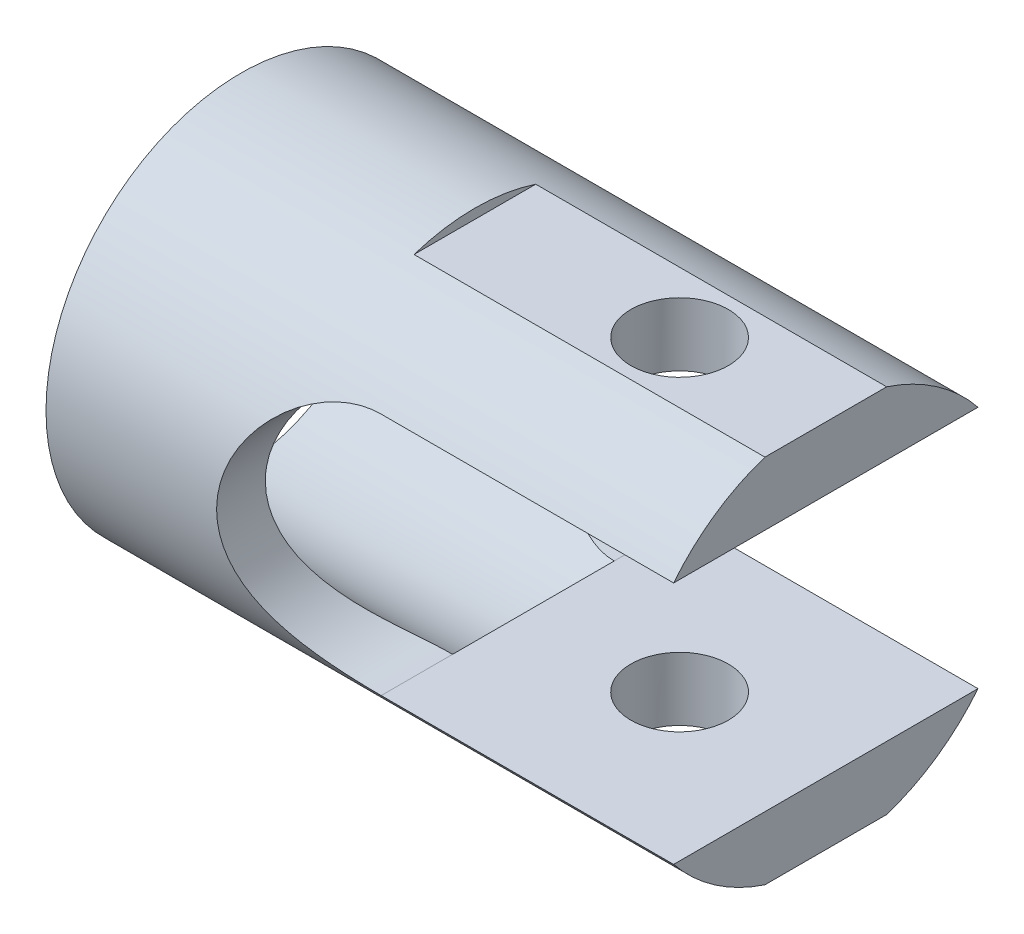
ISO-10303-21;
HEADER;
FILE_DESCRIPTION(('STEP AP214'),'2;1');
FILE_NAME('part.step','',(''),(''),'','','');
FILE_SCHEMA(('AUTOMOTIVE_DESIGN { 1 0 10303 214 1 1 1 1 }'));
ENDSEC;
DATA;
#1=APPLICATION_CONTEXT('core data for automotive mechanical design processes');
#2=APPLICATION_PROTOCOL_DEFINITION('international standard','automotive_design',2000,#1);
#3=PRODUCT_CONTEXT('',#1,'mechanical');
#4=PRODUCT('Part','Part','',(#3));
#5=PRODUCT_RELATED_PRODUCT_CATEGORY('part','',(#4));
#6=PRODUCT_DEFINITION_FORMATION('','',#4);
#7=PRODUCT_DEFINITION_CONTEXT('part definition',#1,'design');
#8=PRODUCT_DEFINITION('design','',#6,#7);
#9=PRODUCT_DEFINITION_SHAPE('','',#8);
#10=(LENGTH_UNIT() NAMED_UNIT(*) SI_UNIT(.MILLI.,.METRE.));
#11=(NAMED_UNIT(*) PLANE_ANGLE_UNIT() SI_UNIT($,.RADIAN.));
#12=(NAMED_UNIT(*) SI_UNIT($,.STERADIAN.) SOLID_ANGLE_UNIT());
#13=UNCERTAINTY_MEASURE_WITH_UNIT(LENGTH_MEASURE(1.E-05),#10,'distance_accuracy_value','');
#14=(GEOMETRIC_REPRESENTATION_CONTEXT(3) GLOBAL_UNCERTAINTY_ASSIGNED_CONTEXT((#13)) GLOBAL_UNIT_ASSIGNED_CONTEXT((#10,
#11,#12)) REPRESENTATION_CONTEXT('',''));
#15=CARTESIAN_POINT('',(0.,0.,0.));
#16=DIRECTION('',(0.,0.,1.));
#17=DIRECTION('',(1.,0.,0.));
#18=AXIS2_PLACEMENT_3D('',#15,#16,#17);
#19=CARTESIAN_POINT('',(-90.1976086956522,0.,0.));
#20=DIRECTION('',(-1.,0.,0.));
#21=DIRECTION('',(0.,0.,1.));
#22=AXIS2_PLACEMENT_3D('',#19,#20,#21);
#23=CYLINDRICAL_SURFACE('',#22,12.7);
#24=CARTESIAN_POINT('',(0.,0.,0.));
#25=DIRECTION('',(-1.,0.,0.));
#26=DIRECTION('',(0.,0.,1.));
#27=AXIS2_PLACEMENT_3D('',#24,#25,#26);
#28=CIRCLE('',#27,12.7);
#29=CARTESIAN_POINT('',(0.,0.,12.7));
#30=VERTEX_POINT('',#29);
#31=EDGE_CURVE('E267',#30,#30,#28,.T.);
#32=ORIENTED_EDGE('',*,*,#31,.F.);
#33=EDGE_LOOP('',(#32));
#34=FACE_BOUND('',#33,.T.);
#35=DIRECTION('',(-1.,0.,0.));
#36=VECTOR('',#35,1.);
#37=CARTESIAN_POINT('',(-90.1976086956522,-12.065,3.96557372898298));
#38=LINE('',#37,#36);
#39=CARTESIAN_POINT('',(38.1,-12.065,3.96557372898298));
#40=VERTEX_POINT('',#39);
#41=CARTESIAN_POINT('',(15.24,-12.065,3.96557372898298));
#42=VERTEX_POINT('',#41);
#43=EDGE_CURVE('E119',#40,#42,#38,.T.);
#44=ORIENTED_EDGE('',*,*,#43,.F.);
#45=CARTESIAN_POINT('',(38.1,0.,0.));
#46=DIRECTION('',(-1.,0.,0.));
#47=DIRECTION('',(0.,0.,1.));
#48=AXIS2_PLACEMENT_3D('',#45,#46,#47);
#49=CIRCLE('',#48,12.7);
#50=CARTESIAN_POINT('',(38.1,-7.93749999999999,9.91393432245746));
#51=VERTEX_POINT('',#50);
#52=EDGE_CURVE('E266',#40,#51,#49,.T.);
#53=ORIENTED_EDGE('',*,*,#52,.T.);
#54=DIRECTION('',(-1.,0.,0.));
#55=VECTOR('',#54,1.);
#56=CARTESIAN_POINT('',(-90.1976086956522,-7.93750000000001,9.91393432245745));
#57=LINE('',#56,#55);
#58=CARTESIAN_POINT('',(19.05,-7.9375,9.91393432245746));
#59=VERTEX_POINT('',#58);
#60=EDGE_CURVE('E257',#51,#59,#57,.T.);
#61=ORIENTED_EDGE('',*,*,#60,.T.);
#62=CARTESIAN_POINT('',(19.05,-7.9375,9.91393432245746));
#63=CARTESIAN_POINT('',(18.9506414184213,-7.93750132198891,9.91393048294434));
#64=CARTESIAN_POINT('',(18.8512986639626,-7.93563390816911,9.91542871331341));
#65=CARTESIAN_POINT('',(18.6528496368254,-7.92817981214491,9.92139094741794));
#66=CARTESIAN_POINT('',(18.553743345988,-7.92259342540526,9.92585471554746));
#67=CARTESIAN_POINT('',(18.2573282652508,-7.90030263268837,9.94362122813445));
#68=CARTESIAN_POINT('',(18.0606553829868,-7.87806648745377,9.9612993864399));
#69=CARTESIAN_POINT('',(17.6725107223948,-7.81950417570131,10.0073329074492));
#70=CARTESIAN_POINT('',(17.4810086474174,-7.78330173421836,10.0355944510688));
#71=CARTESIAN_POINT('',(17.1027119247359,-7.69737667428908,10.1016495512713));
#72=CARTESIAN_POINT('',(16.9159183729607,-7.64765093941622,10.1394453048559));
#73=CARTESIAN_POINT('',(16.5489124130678,-7.53559087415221,10.2229997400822));
#74=CARTESIAN_POINT('',(16.3686754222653,-7.47331099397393,10.2687239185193));
#75=CARTESIAN_POINT('',(16.0147430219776,-7.33669644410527,10.3667717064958));
#76=CARTESIAN_POINT('',(15.8410473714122,-7.26236221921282,10.4190950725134));
#77=CARTESIAN_POINT('',(15.3298411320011,-7.02184866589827,10.5840183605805));
#78=CARTESIAN_POINT('',(15.0028575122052,-6.83835875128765,10.7044151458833));
#79=CARTESIAN_POINT('',(14.3389759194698,-6.40220834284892,10.971570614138));
#80=CARTESIAN_POINT('',(14.0065460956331,-6.14359319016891,11.1197055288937));
#81=CARTESIAN_POINT('',(13.5414916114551,-5.71877275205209,11.3406913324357));
#82=CARTESIAN_POINT('',(13.3920061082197,-5.57093392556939,11.4141866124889));
#83=CARTESIAN_POINT('',(13.1047447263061,-5.26328195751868,11.5592712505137));
#84=CARTESIAN_POINT('',(12.9669713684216,-5.10346625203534,11.6308601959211));
#85=CARTESIAN_POINT('',(12.6879598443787,-4.75232118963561,11.7790507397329));
#86=CARTESIAN_POINT('',(12.5483301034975,-4.55952108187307,11.8552063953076));
#87=CARTESIAN_POINT('',(12.2860482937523,-4.1605080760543,12.0010525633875));
#88=CARTESIAN_POINT('',(12.1633884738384,-3.95430136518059,12.0707460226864));
#89=CARTESIAN_POINT('',(11.9363609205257,-3.52958853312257,12.201694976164));
#90=CARTESIAN_POINT('',(11.8319858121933,-3.31108741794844,12.2629538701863));
#91=CARTESIAN_POINT('',(11.6429061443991,-2.86320118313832,12.3751905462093));
#92=CARTESIAN_POINT('',(11.5581980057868,-2.63381805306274,12.4261701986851));
#93=CARTESIAN_POINT('',(11.4173712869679,-2.18985700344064,12.5116072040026));
#94=CARTESIAN_POINT('',(11.3592217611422,-1.97614451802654,12.5472173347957));
#95=CARTESIAN_POINT('',(11.2607859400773,-1.54315419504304,12.6077928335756));
#96=CARTESIAN_POINT('',(11.2204985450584,-1.32387670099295,12.6327588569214));
#97=CARTESIAN_POINT('',(11.1584925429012,-0.881912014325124,12.6712822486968));
#98=CARTESIAN_POINT('',(11.1367577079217,-0.659227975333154,12.6848495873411));
#99=CARTESIAN_POINT('',(11.1121903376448,-0.212423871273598,12.7001897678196));
#100=CARTESIAN_POINT('',(11.109355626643,0.0116960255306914,12.7019639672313));
#101=CARTESIAN_POINT('',(11.1217351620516,0.429035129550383,12.6942296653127));
#102=CARTESIAN_POINT('',(11.1345742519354,0.622358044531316,12.6862058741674));
#103=CARTESIAN_POINT('',(11.1742631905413,1.00700075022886,12.6614802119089));
#104=CARTESIAN_POINT('',(11.2011128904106,1.19832056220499,12.6447784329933));
#105=CARTESIAN_POINT('',(11.2684730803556,1.57760852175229,12.6030772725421));
#106=CARTESIAN_POINT('',(11.3089834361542,1.76557670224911,12.5780779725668));
#107=CARTESIAN_POINT('',(11.403170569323,2.13696357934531,12.5203319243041));
#108=CARTESIAN_POINT('',(11.456847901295,2.3203820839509,12.4875848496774));
#109=CARTESIAN_POINT('',(11.5769174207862,2.68203711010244,12.414941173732));
#110=CARTESIAN_POINT('',(11.6433387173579,2.86026067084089,12.3750282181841));
#111=CARTESIAN_POINT('',(11.7881610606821,3.21021923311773,12.2888983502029));
#112=CARTESIAN_POINT('',(11.8665660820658,3.38195205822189,12.2426793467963));
#113=CARTESIAN_POINT('',(12.1187174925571,3.88616389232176,12.0958667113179));
#114=CARTESIAN_POINT('',(12.30949077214,4.20792554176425,11.9870613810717));
#115=CARTESIAN_POINT('',(12.7572994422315,4.85591824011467,11.7407373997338));
#116=CARTESIAN_POINT('',(13.0196233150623,5.17773489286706,11.601330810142));
#117=CARTESIAN_POINT('',(13.5897706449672,5.7758762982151,11.3154403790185));
#118=CARTESIAN_POINT('',(13.8976757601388,6.0521174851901,11.1689441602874));
#119=CARTESIAN_POINT('',(14.4115144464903,6.44539301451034,10.944124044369));
#120=CARTESIAN_POINT('',(14.603746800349,6.57951040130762,10.8637929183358));
#121=CARTESIAN_POINT('',(15.0006890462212,6.83097112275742,10.7074607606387));
#122=CARTESIAN_POINT('',(15.2054009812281,6.94831170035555,10.6314604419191));
#123=CARTESIAN_POINT('',(15.6257313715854,7.1647740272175,10.4867973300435));
#124=CARTESIAN_POINT('',(15.8413089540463,7.2639583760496,10.4181096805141));
#125=CARTESIAN_POINT('',(16.283014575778,7.44341786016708,10.2906586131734));
#126=CARTESIAN_POINT('',(16.5091392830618,7.52369891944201,10.2318920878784));
#127=CARTESIAN_POINT('',(16.9231509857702,7.64965105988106,10.1379329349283));
#128=CARTESIAN_POINT('',(17.1093740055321,7.69904336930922,10.1003773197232));
#129=CARTESIAN_POINT('',(17.4864654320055,7.78438272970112,10.0347540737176));
#130=CARTESIAN_POINT('',(17.6773320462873,7.82033488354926,10.0066828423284));
#131=CARTESIAN_POINT('',(18.0641404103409,7.87848593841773,9.96096662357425));
#132=CARTESIAN_POINT('',(18.260111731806,7.90056356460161,9.94341363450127));
#133=CARTESIAN_POINT('',(18.5554739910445,7.9226972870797,9.92577176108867));
#134=CARTESIAN_POINT('',(18.65423554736,7.92824477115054,9.92133901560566));
#135=CARTESIAN_POINT('',(18.8519928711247,7.93564694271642,9.9154182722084));
#136=CARTESIAN_POINT('',(18.9509886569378,7.93750133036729,9.91393051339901));
#137=CARTESIAN_POINT('',(19.05,7.9375,9.91393432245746));
#138=B_SPLINE_CURVE_WITH_KNOTS('',3,(#62,#63,#64,#65,#66,#67,#68,#69,#70,#71,#72,#73,#74,#75,
#76,#77,#78,#79,#80,#81,#82,#83,#84,#85,#86,#87,#88,#89,#90,#91,#92,#93,#94,#95,#96,#97,#98,#99,
#100,#101,#102,#103,#104,#105,#106,#107,#108,#109,#110,#111,#112,#113,#114,#115,#116,#117,#118,
#119,#120,#121,#122,#123,#124,#125,#126,#127,#128,#129,#130,#131,#132,#133,#134,#135,#136,#137),
.UNSPECIFIED.,.F.,.F.,(4,2,2,2,2,2,2,2,2,2,2,2,2,2,2,2,2,2,2,2,2,2,2,2,2,2,2,2,2,2,2,2,2,2,2,2,
2,4),(0.,0.29801589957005,0.596008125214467,1.19119225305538,1.78122053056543,2.37138489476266,
2.95904262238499,3.54667867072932,4.72401261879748,6.05797390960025,6.72561637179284,
7.393402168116,8.14222496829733,8.890704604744,9.63888165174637,10.3869224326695,
11.0589194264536,11.7308750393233,12.4022422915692,13.073532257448,13.6545782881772,
14.2356181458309,14.8166522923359,15.3977109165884,15.9801129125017,16.562708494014,
17.7270398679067,19.0360755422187,20.3474853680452,21.0900521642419,21.8327408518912,
22.5728185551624,23.3126640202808,23.9008436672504,24.4887997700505,25.0818261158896,
25.3787770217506,25.6757520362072),.UNSPECIFIED.);
#139=CARTESIAN_POINT('',(19.05,7.9375,9.91393432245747));
#140=VERTEX_POINT('',#139);
#141=EDGE_CURVE('E175',#59,#140,#138,.T.);
#142=ORIENTED_EDGE('',*,*,#141,.T.);
#143=DIRECTION('',(-1.,0.,0.));
#144=VECTOR('',#143,1.);
#145=CARTESIAN_POINT('',(-90.1976086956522,7.93749999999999,9.91393432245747));
#146=LINE('',#145,#144);
#147=CARTESIAN_POINT('',(38.1,7.93749999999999,9.91393432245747));
#148=VERTEX_POINT('',#147);
#149=EDGE_CURVE('E190',#140,#148,#146,.F.);
#150=ORIENTED_EDGE('',*,*,#149,.T.);
#151=CARTESIAN_POINT('',(38.1,12.065,3.96557372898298));
#152=VERTEX_POINT('',#151);
#153=EDGE_CURVE('E225',#148,#152,#49,.T.);
#154=ORIENTED_EDGE('',*,*,#153,.T.);
#155=DIRECTION('',(-1.,0.,0.));
#156=VECTOR('',#155,1.);
#157=CARTESIAN_POINT('',(-90.1976086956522,12.065,3.96557372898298));
#158=LINE('',#157,#156);
#159=CARTESIAN_POINT('',(15.24,12.065,3.96557372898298));
#160=VERTEX_POINT('',#159);
#161=EDGE_CURVE('E248',#160,#152,#158,.F.);
#162=ORIENTED_EDGE('',*,*,#161,.F.);
#163=CARTESIAN_POINT('',(15.24,0.,0.));
#164=DIRECTION('',(1.,0.,0.));
#165=DIRECTION('',(0.,0.,-1.));
#166=AXIS2_PLACEMENT_3D('',#163,#164,#165);
#167=CIRCLE('',#166,12.7);
#168=CARTESIAN_POINT('',(15.24,12.065,-3.96557372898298));
#169=VERTEX_POINT('',#168);
#170=EDGE_CURVE('E251',#169,#160,#167,.T.);
#171=ORIENTED_EDGE('',*,*,#170,.F.);
#172=DIRECTION('',(-1.,0.,0.));
#173=VECTOR('',#172,1.);
#174=CARTESIAN_POINT('',(-90.1976086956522,12.065,-3.96557372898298));
#175=LINE('',#174,#173);
#176=CARTESIAN_POINT('',(38.1,12.065,-3.96557372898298));
#177=VERTEX_POINT('',#176);
#178=EDGE_CURVE('E246',#177,#169,#175,.T.);
#179=ORIENTED_EDGE('',*,*,#178,.F.);
#180=CARTESIAN_POINT('',(38.1,7.93750000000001,-9.91393432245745));
#181=VERTEX_POINT('',#180);
#182=EDGE_CURVE('E229',#177,#181,#49,.T.);
#183=ORIENTED_EDGE('',*,*,#182,.T.);
#184=DIRECTION('',(-1.,0.,0.));
#185=VECTOR('',#184,1.);
#186=CARTESIAN_POINT('',(-90.1976086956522,7.93749999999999,-9.91393432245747));
#187=LINE('',#186,#185);
#188=CARTESIAN_POINT('',(19.05,7.9375,-9.91393432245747));
#189=VERTEX_POINT('',#188);
#190=EDGE_CURVE('E258',#181,#189,#187,.T.);
#191=ORIENTED_EDGE('',*,*,#190,.T.);
#192=CARTESIAN_POINT('',(19.05,7.9375,-9.91393432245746));
#193=CARTESIAN_POINT('',(18.9506414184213,7.93750132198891,-9.91393048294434));
#194=CARTESIAN_POINT('',(18.8512986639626,7.93563390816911,-9.91542871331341));
#195=CARTESIAN_POINT('',(18.6528496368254,7.92817981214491,-9.92139094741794));
#196=CARTESIAN_POINT('',(18.553743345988,7.92259342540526,-9.92585471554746));
#197=CARTESIAN_POINT('',(18.2573282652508,7.90030263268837,-9.94362122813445));
#198=CARTESIAN_POINT('',(18.0606553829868,7.87806648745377,-9.9612993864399));
#199=CARTESIAN_POINT('',(17.6725107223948,7.81950417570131,-10.0073329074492));
#200=CARTESIAN_POINT('',(17.4810086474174,7.78330173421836,-10.0355944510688));
#201=CARTESIAN_POINT('',(17.1027119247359,7.69737667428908,-10.1016495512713));
#202=CARTESIAN_POINT('',(16.9159183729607,7.64765093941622,-10.1394453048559));
#203=CARTESIAN_POINT('',(16.5489124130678,7.53559087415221,-10.2229997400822));
#204=CARTESIAN_POINT('',(16.3686754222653,7.47331099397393,-10.2687239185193));
#205=CARTESIAN_POINT('',(16.0147430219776,7.33669644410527,-10.3667717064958));
#206=CARTESIAN_POINT('',(15.8410473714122,7.26236221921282,-10.4190950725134));
#207=CARTESIAN_POINT('',(15.3298411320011,7.02184866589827,-10.5840183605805));
#208=CARTESIAN_POINT('',(15.0028575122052,6.83835875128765,-10.7044151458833));
#209=CARTESIAN_POINT('',(14.3389759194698,6.40220834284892,-10.971570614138));
#210=CARTESIAN_POINT('',(14.0065460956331,6.14359319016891,-11.1197055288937));
#211=CARTESIAN_POINT('',(13.5414916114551,5.71877275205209,-11.3406913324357));
#212=CARTESIAN_POINT('',(13.3920061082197,5.57093392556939,-11.4141866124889));
#213=CARTESIAN_POINT('',(13.1047447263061,5.26328195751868,-11.5592712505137));
#214=CARTESIAN_POINT('',(12.9669713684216,5.10346625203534,-11.6308601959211));
#215=CARTESIAN_POINT('',(12.6879598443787,4.75232118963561,-11.7790507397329));
#216=CARTESIAN_POINT('',(12.5483301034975,4.55952108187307,-11.8552063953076));
#217=CARTESIAN_POINT('',(12.2860482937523,4.1605080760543,-12.0010525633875));
#218=CARTESIAN_POINT('',(12.1633884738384,3.95430136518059,-12.0707460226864));
#219=CARTESIAN_POINT('',(11.9363609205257,3.52958853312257,-12.201694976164));
#220=CARTESIAN_POINT('',(11.8319858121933,3.31108741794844,-12.2629538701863));
#221=CARTESIAN_POINT('',(11.6429061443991,2.86320118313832,-12.3751905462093));
#222=CARTESIAN_POINT('',(11.5581980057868,2.63381805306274,-12.4261701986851));
#223=CARTESIAN_POINT('',(11.4173712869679,2.18985700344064,-12.5116072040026));
#224=CARTESIAN_POINT('',(11.3592217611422,1.97614451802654,-12.5472173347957));
#225=CARTESIAN_POINT('',(11.2607859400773,1.54315419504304,-12.6077928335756));
#226=CARTESIAN_POINT('',(11.2204985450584,1.32387670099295,-12.6327588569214));
#227=CARTESIAN_POINT('',(11.1584925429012,0.881912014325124,-12.6712822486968));
#228=CARTESIAN_POINT('',(11.1367577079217,0.659227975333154,-12.6848495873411));
#229=CARTESIAN_POINT('',(11.1121903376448,0.212423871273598,-12.7001897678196));
#230=CARTESIAN_POINT('',(11.109355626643,-0.0116960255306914,-12.7019639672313));
#231=CARTESIAN_POINT('',(11.1217351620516,-0.429035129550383,-12.6942296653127));
#232=CARTESIAN_POINT('',(11.1345742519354,-0.622358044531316,-12.6862058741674));
#233=CARTESIAN_POINT('',(11.1742631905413,-1.00700075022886,-12.6614802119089));
#234=CARTESIAN_POINT('',(11.2011128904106,-1.19832056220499,-12.6447784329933));
#235=CARTESIAN_POINT('',(11.2684730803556,-1.57760852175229,-12.6030772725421));
#236=CARTESIAN_POINT('',(11.3089834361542,-1.76557670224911,-12.5780779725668));
#237=CARTESIAN_POINT('',(11.403170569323,-2.13696357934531,-12.5203319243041));
#238=CARTESIAN_POINT('',(11.456847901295,-2.3203820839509,-12.4875848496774));
#239=CARTESIAN_POINT('',(11.5769174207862,-2.68203711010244,-12.414941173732));
#240=CARTESIAN_POINT('',(11.6433387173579,-2.86026067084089,-12.3750282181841));
#241=CARTESIAN_POINT('',(11.7881610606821,-3.21021923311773,-12.2888983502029));
#242=CARTESIAN_POINT('',(11.8665660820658,-3.38195205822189,-12.2426793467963));
#243=CARTESIAN_POINT('',(12.1187174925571,-3.88616389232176,-12.0958667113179));
#244=CARTESIAN_POINT('',(12.30949077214,-4.20792554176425,-11.9870613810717));
#245=CARTESIAN_POINT('',(12.7572994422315,-4.85591824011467,-11.7407373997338));
#246=CARTESIAN_POINT('',(13.0196233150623,-5.17773489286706,-11.601330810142));
#247=CARTESIAN_POINT('',(13.5897706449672,-5.7758762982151,-11.3154403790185));
#248=CARTESIAN_POINT('',(13.8976757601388,-6.0521174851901,-11.1689441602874));
#249=CARTESIAN_POINT('',(14.4115144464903,-6.44539301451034,-10.944124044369));
#250=CARTESIAN_POINT('',(14.603746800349,-6.57951040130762,-10.8637929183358));
#251=CARTESIAN_POINT('',(15.0006890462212,-6.83097112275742,-10.7074607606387));
#252=CARTESIAN_POINT('',(15.2054009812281,-6.94831170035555,-10.6314604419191));
#253=CARTESIAN_POINT('',(15.6257313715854,-7.1647740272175,-10.4867973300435));
#254=CARTESIAN_POINT('',(15.8413089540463,-7.2639583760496,-10.4181096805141));
#255=CARTESIAN_POINT('',(16.283014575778,-7.44341786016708,-10.2906586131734));
#256=CARTESIAN_POINT('',(16.5091392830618,-7.52369891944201,-10.2318920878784));
#257=CARTESIAN_POINT('',(16.9231509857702,-7.64965105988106,-10.1379329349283));
#258=CARTESIAN_POINT('',(17.1093740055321,-7.69904336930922,-10.1003773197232));
#259=CARTESIAN_POINT('',(17.4864654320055,-7.78438272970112,-10.0347540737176));
#260=CARTESIAN_POINT('',(17.6773320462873,-7.82033488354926,-10.0066828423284));
#261=CARTESIAN_POINT('',(18.0641404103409,-7.87848593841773,-9.96096662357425));
#262=CARTESIAN_POINT('',(18.260111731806,-7.90056356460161,-9.94341363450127));
#263=CARTESIAN_POINT('',(18.5554739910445,-7.9226972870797,-9.92577176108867));
#264=CARTESIAN_POINT('',(18.65423554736,-7.92824477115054,-9.92133901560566));
#265=CARTESIAN_POINT('',(18.8519928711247,-7.93564694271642,-9.9154182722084));
#266=CARTESIAN_POINT('',(18.9509886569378,-7.93750133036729,-9.91393051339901));
#267=CARTESIAN_POINT('',(19.05,-7.9375,-9.91393432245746));
#268=B_SPLINE_CURVE_WITH_KNOTS('',3,(#192,#193,#194,#195,#196,#197,#198,#199,#200,#201,#202,
#203,#204,#205,#206,#207,#208,#209,#210,#211,#212,#213,#214,#215,#216,#217,#218,#219,#220,#221,
#222,#223,#224,#225,#226,#227,#228,#229,#230,#231,#232,#233,#234,#235,#236,#237,#238,#239,#240,
#241,#242,#243,#244,#245,#246,#247,#248,#249,#250,#251,#252,#253,#254,#255,#256,#257,#258,#259,
#260,#261,#262,#263,#264,#265,#266,#267),.UNSPECIFIED.,.F.,.F.,(4,2,2,2,2,2,2,2,2,2,2,2,2,2,2,2,
2,2,2,2,2,2,2,2,2,2,2,2,2,2,2,2,2,2,2,2,2,4),(0.,0.29801589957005,0.596008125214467,
1.19119225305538,1.78122053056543,2.37138489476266,2.95904262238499,3.54667867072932,
4.72401261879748,6.05797390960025,6.72561637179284,7.393402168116,8.14222496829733,
8.890704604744,9.63888165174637,10.3869224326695,11.0589194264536,11.7308750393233,
12.4022422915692,13.073532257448,13.6545782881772,14.2356181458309,14.8166522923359,
15.3977109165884,15.9801129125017,16.562708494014,17.7270398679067,19.0360755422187,
20.3474853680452,21.0900521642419,21.8327408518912,22.5728185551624,23.3126640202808,
23.9008436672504,24.4887997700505,25.0818261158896,25.3787770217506,25.6757520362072),.UNSPECIFIED.);
#269=CARTESIAN_POINT('',(19.05,-7.9375,-9.91393432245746));
#270=VERTEX_POINT('',#269);
#271=EDGE_CURVE('E183',#189,#270,#268,.T.);
#272=ORIENTED_EDGE('',*,*,#271,.T.);
#273=DIRECTION('',(-1.,0.,0.));
#274=VECTOR('',#273,1.);
#275=CARTESIAN_POINT('',(-90.1976086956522,-7.93750000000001,-9.91393432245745));
#276=LINE('',#275,#274);
#277=CARTESIAN_POINT('',(38.1,-7.93750000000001,-9.91393432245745));
#278=VERTEX_POINT('',#277);
#279=EDGE_CURVE('E189',#270,#278,#276,.F.);
#280=ORIENTED_EDGE('',*,*,#279,.T.);
#281=CARTESIAN_POINT('',(38.1,-12.065,-3.96557372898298));
#282=VERTEX_POINT('',#281);
#283=EDGE_CURVE('E125',#278,#282,#49,.T.);
#284=ORIENTED_EDGE('',*,*,#283,.T.);
#285=DIRECTION('',(-1.,0.,0.));
#286=VECTOR('',#285,1.);
#287=CARTESIAN_POINT('',(-90.1976086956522,-12.065,-3.96557372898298));
#288=LINE('',#287,#286);
#289=CARTESIAN_POINT('',(15.24,-12.065,-3.96557372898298));
#290=VERTEX_POINT('',#289);
#291=EDGE_CURVE('E52',#290,#282,#288,.F.);
#292=ORIENTED_EDGE('',*,*,#291,.F.);
#293=CARTESIAN_POINT('',(15.24,0.,0.));
#294=DIRECTION('',(1.,0.,0.));
#295=DIRECTION('',(0.,0.,-1.));
#296=AXIS2_PLACEMENT_3D('',#293,#294,#295);
#297=CIRCLE('',#296,12.7);
#298=EDGE_CURVE('E11',#42,#290,#297,.T.);
#299=ORIENTED_EDGE('',*,*,#298,.F.);
#300=EDGE_LOOP('',(#44,#53,#61,#142,#150,#154,#162,#171,#179,#183,#191,#272,#280,#284,#292,#299));
#301=FACE_BOUND('',#300,.T.);
#302=ADVANCED_FACE('F36',(#34,#301),#23,.T.);
#303=CARTESIAN_POINT('',(38.1,12.7,0.));
#304=DIRECTION('',(-1.,0.,0.));
#305=DIRECTION('',(0.,0.,1.));
#306=AXIS2_PLACEMENT_3D('',#303,#304,#305);
#307=PLANE('',#306);
#308=DIRECTION('',(0.,0.,1.));
#309=VECTOR('',#308,1.);
#310=CARTESIAN_POINT('',(38.1,-12.065,0.));
#311=LINE('',#310,#309);
#312=EDGE_CURVE('E45',#282,#40,#311,.T.);
#313=ORIENTED_EDGE('',*,*,#312,.F.);
#314=ORIENTED_EDGE('',*,*,#283,.F.);
#315=DIRECTION('',(0.,0.,1.));
#316=VECTOR('',#315,1.);
#317=CARTESIAN_POINT('',(38.1,-7.93749999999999,0.));
#318=LINE('',#317,#316);
#319=EDGE_CURVE('E265',#278,#51,#318,.T.);
#320=ORIENTED_EDGE('',*,*,#319,.T.);
#321=ORIENTED_EDGE('',*,*,#52,.F.);
#322=EDGE_LOOP('',(#313,#314,#320,#321));
#323=FACE_BOUND('',#322,.T.);
#324=ADVANCED_FACE('F195',(#323),#307,.F.);
#325=DIRECTION('',(0.,0.,-1.));
#326=VECTOR('',#325,1.);
#327=CARTESIAN_POINT('',(38.1,12.065,12.7));
#328=LINE('',#327,#326);
#329=EDGE_CURVE('E130',#152,#177,#328,.T.);
#330=ORIENTED_EDGE('',*,*,#329,.F.);
#331=ORIENTED_EDGE('',*,*,#153,.F.);
#332=DIRECTION('',(0.,0.,-1.));
#333=VECTOR('',#332,1.);
#334=CARTESIAN_POINT('',(38.1,7.93750000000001,0.));
#335=LINE('',#334,#333);
#336=EDGE_CURVE('E143',#148,#181,#335,.T.);
#337=ORIENTED_EDGE('',*,*,#336,.T.);
#338=ORIENTED_EDGE('',*,*,#182,.F.);
#339=EDGE_LOOP('',(#330,#331,#337,#338));
#340=FACE_BOUND('',#339,.T.);
#341=ADVANCED_FACE('F197',(#340),#307,.F.);
#342=CARTESIAN_POINT('',(19.05,9.525,0.));
#343=DIRECTION('',(1.,0.,0.));
#344=DIRECTION('',(0.,0.,-1.));
#345=AXIS2_PLACEMENT_3D('',#342,#343,#344);
#346=PLANE('',#345);
#347=CARTESIAN_POINT('',(19.05,0.,0.));
#348=DIRECTION('',(-1.,0.,0.));
#349=DIRECTION('',(0.,0.,1.));
#350=AXIS2_PLACEMENT_3D('',#347,#348,#349);
#351=CIRCLE('',#350,9.525);
#352=CARTESIAN_POINT('',(19.05,-7.9375,-5.2651418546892));
#353=VERTEX_POINT('',#352);
#354=CARTESIAN_POINT('',(19.05,-7.9375,5.2651418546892));
#355=VERTEX_POINT('',#354);
#356=EDGE_CURVE('E221',#353,#355,#351,.T.);
#357=ORIENTED_EDGE('',*,*,#356,.T.);
#358=DIRECTION('',(0.,0.,1.));
#359=VECTOR('',#358,1.);
#360=CARTESIAN_POINT('',(19.05,-7.9375,-12.7));
#361=LINE('',#360,#359);
#362=EDGE_CURVE('E137',#353,#355,#361,.T.);
#363=ORIENTED_EDGE('',*,*,#362,.F.);
#364=EDGE_LOOP('',(#357,#363));
#365=FACE_BOUND('',#364,.T.);
#366=ADVANCED_FACE('F200',(#365),#346,.F.);
#367=CARTESIAN_POINT('',(0.,12.7,0.));
#368=DIRECTION('',(1.,0.,0.));
#369=DIRECTION('',(0.,0.,-1.));
#370=AXIS2_PLACEMENT_3D('',#367,#368,#369);
#371=PLANE('',#370);
#372=CARTESIAN_POINT('',(0.,0.,0.));
#373=DIRECTION('',(-1.,0.,0.));
#374=DIRECTION('',(0.,0.,1.));
#375=AXIS2_PLACEMENT_3D('',#372,#373,#374);
#376=CIRCLE('',#375,9.525);
#377=CARTESIAN_POINT('',(0.,0.,9.525));
#378=VERTEX_POINT('',#377);
#379=EDGE_CURVE('E227',#378,#378,#376,.T.);
#380=ORIENTED_EDGE('',*,*,#379,.F.);
#381=EDGE_LOOP('',(#380));
#382=FACE_BOUND('',#381,.T.);
#383=ORIENTED_EDGE('',*,*,#31,.T.);
#384=EDGE_LOOP('',(#383));
#385=FACE_BOUND('',#384,.T.);
#386=ADVANCED_FACE('F38',(#382,#385),#371,.F.);
#387=CARTESIAN_POINT('',(-90.1976086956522,0.,0.));
#388=DIRECTION('',(-1.,0.,0.));
#389=DIRECTION('',(0.,0.,1.));
#390=AXIS2_PLACEMENT_3D('',#387,#388,#389);
#391=CYLINDRICAL_SURFACE('',#390,9.525);
#392=ORIENTED_EDGE('',*,*,#356,.F.);
#393=CARTESIAN_POINT('',(19.05,-7.9375,-5.2651418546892));
#394=CARTESIAN_POINT('',(18.9081812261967,-7.93753372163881,-5.26503974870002));
#395=CARTESIAN_POINT('',(18.7664263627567,-7.93370080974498,-5.27086917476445));
#396=CARTESIAN_POINT('',(18.4844723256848,-7.91857513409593,-5.29359232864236));
#397=CARTESIAN_POINT('',(18.3442706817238,-7.9072967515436,-5.31046472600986));
#398=CARTESIAN_POINT('',(18.0683335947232,-7.87776971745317,-5.35415800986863));
#399=CARTESIAN_POINT('',(17.9325628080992,-7.85962568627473,-5.38082940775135));
#400=CARTESIAN_POINT('',(17.6640558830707,-7.81674848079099,-5.44293116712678));
#401=CARTESIAN_POINT('',(17.5313214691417,-7.79201165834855,-5.47836637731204));
#402=CARTESIAN_POINT('',(17.2174222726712,-7.72531836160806,-5.57221384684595));
#403=CARTESIAN_POINT('',(17.0379384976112,-7.680423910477,-5.63416419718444));
#404=CARTESIAN_POINT('',(16.6863784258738,-7.57962270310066,-5.7690580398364));
#405=CARTESIAN_POINT('',(16.5143051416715,-7.52371151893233,-5.84200594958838));
#406=CARTESIAN_POINT('',(16.1762355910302,-7.40121318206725,-5.99645354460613));
#407=CARTESIAN_POINT('',(16.0102966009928,-7.33454682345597,-6.07801499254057));
#408=CARTESIAN_POINT('',(15.6856218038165,-7.19140801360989,-6.24672176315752));
#409=CARTESIAN_POINT('',(15.5268883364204,-7.11493240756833,-6.33386887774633));
#410=CARTESIAN_POINT('',(15.147681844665,-6.91662657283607,-6.55103154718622));
#411=CARTESIAN_POINT('',(14.9309550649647,-6.78969707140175,-6.68295896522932));
#412=CARTESIAN_POINT('',(14.511456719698,-6.51675968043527,-6.9493815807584));
#413=CARTESIAN_POINT('',(14.3086910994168,-6.37074373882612,-7.08387784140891));
#414=CARTESIAN_POINT('',(13.9177040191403,-6.06016741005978,-7.35132039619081));
#415=CARTESIAN_POINT('',(13.7294519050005,-5.89564801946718,-7.48426942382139));
#416=CARTESIAN_POINT('',(13.3677459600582,-5.5478641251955,-7.74558710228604));
#417=CARTESIAN_POINT('',(13.1942865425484,-5.36460675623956,-7.87395747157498));
#418=CARTESIAN_POINT('',(12.8984213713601,-5.02016358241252,-8.09668412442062));
#419=CARTESIAN_POINT('',(12.772979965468,-4.86251452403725,-8.19248939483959));
#420=CARTESIAN_POINT('',(12.5329270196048,-4.53571982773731,-8.37783622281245));
#421=CARTESIAN_POINT('',(12.4183132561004,-4.36657656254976,-8.46737906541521));
#422=CARTESIAN_POINT('',(12.2010603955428,-4.01723750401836,-8.63858953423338));
#423=CARTESIAN_POINT('',(12.0984093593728,-3.83705300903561,-8.72026499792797));
#424=CARTESIAN_POINT('',(11.9061752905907,-3.46602107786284,-8.87426849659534));
#425=CARTESIAN_POINT('',(11.8165898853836,-3.27517558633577,-8.9465982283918));
#426=CARTESIAN_POINT('',(11.6660532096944,-2.91754975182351,-9.0687820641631));
#427=CARTESIAN_POINT('',(11.6028291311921,-2.75231252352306,-9.12036002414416));
#428=CARTESIAN_POINT('',(11.4869850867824,-2.4158542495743,-9.21519429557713));
#429=CARTESIAN_POINT('',(11.4343629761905,-2.24463442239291,-9.25845229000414));
#430=CARTESIAN_POINT('',(11.3404557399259,-1.89715789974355,-9.33584942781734));
#431=CARTESIAN_POINT('',(11.2991663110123,-1.72090314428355,-9.36999203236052));
#432=CARTESIAN_POINT('',(11.2285345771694,-1.36440484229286,-9.4285019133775));
#433=CARTESIAN_POINT('',(11.1991924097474,-1.18416124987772,-9.45286907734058));
#434=CARTESIAN_POINT('',(11.1528522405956,-0.820215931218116,-9.49139054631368));
#435=CARTESIAN_POINT('',(11.135907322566,-0.636502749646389,-9.50550093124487));
#436=CARTESIAN_POINT('',(11.1148715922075,-0.267829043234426,-9.52302197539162));
#437=CARTESIAN_POINT('',(11.1107808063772,-0.0828685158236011,-9.52643261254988));
#438=CARTESIAN_POINT('',(11.1155286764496,0.28676644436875,-9.52247616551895));
#439=CARTESIAN_POINT('',(11.124367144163,0.471440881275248,-9.51510923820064));
#440=CARTESIAN_POINT('',(11.1548113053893,0.838990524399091,-9.48976565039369));
#441=CARTESIAN_POINT('',(11.1764165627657,1.02186579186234,-9.47178935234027));
#442=CARTESIAN_POINT('',(11.2301325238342,1.37216328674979,-9.42718615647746));
#443=CARTESIAN_POINT('',(11.261436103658,1.53979566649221,-9.40122472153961));
#444=CARTESIAN_POINT('',(11.3343709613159,1.87130773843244,-9.34089024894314));
#445=CARTESIAN_POINT('',(11.376005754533,2.03518613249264,-9.30651434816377));
#446=CARTESIAN_POINT('',(11.4690386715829,2.35821294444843,-9.22995091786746));
#447=CARTESIAN_POINT('',(11.5204336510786,2.51736286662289,-9.18776590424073));
#448=CARTESIAN_POINT('',(11.6323932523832,2.83031339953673,-9.09623963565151));
#449=CARTESIAN_POINT('',(11.6929612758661,2.98411199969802,-9.04689572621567));
#450=CARTESIAN_POINT('',(11.8985385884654,3.46226407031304,-8.88021832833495));
#451=CARTESIAN_POINT('',(12.0594752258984,3.77577276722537,-8.75084857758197));
#452=CARTESIAN_POINT('',(12.4155507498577,4.37135607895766,-8.46910473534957));
#453=CARTESIAN_POINT('',(12.6107200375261,4.65340238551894,-8.31671021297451));
#454=CARTESIAN_POINT('',(12.9753114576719,5.11512249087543,-8.03825856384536));
#455=CARTESIAN_POINT('',(13.1381052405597,5.30227079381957,-7.91574585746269));
#456=CARTESIAN_POINT('',(13.4783398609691,5.65873244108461,-7.6649764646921));
#457=CARTESIAN_POINT('',(13.6557873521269,5.82803760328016,-7.5367171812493));
#458=CARTESIAN_POINT('',(14.0246438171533,6.14894910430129,-7.27727247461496));
#459=CARTESIAN_POINT('',(14.2160749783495,6.3005262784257,-7.14608264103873));
#460=CARTESIAN_POINT('',(14.6122442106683,6.58557320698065,-6.88427516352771));
#461=CARTESIAN_POINT('',(14.8169774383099,6.71904949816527,-6.753657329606));
#462=CARTESIAN_POINT('',(15.1836668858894,6.93453388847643,-6.53108591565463));
#463=CARTESIAN_POINT('',(15.3425104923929,7.02078674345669,-6.4380920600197));
#464=CARTESIAN_POINT('',(15.6677499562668,7.18312884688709,-6.25644542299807));
#465=CARTESIAN_POINT('',(15.8341463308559,7.25921739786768,-6.16779293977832));
#466=CARTESIAN_POINT('',(16.1744494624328,7.40060593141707,-5.99740660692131));
#467=CARTESIAN_POINT('',(16.3483397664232,7.46592816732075,-5.91565866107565));
#468=CARTESIAN_POINT('',(16.7040211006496,7.58521677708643,-5.76190683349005));
#469=CARTESIAN_POINT('',(16.8858081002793,7.63918886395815,-5.68989805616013));
#470=CARTESIAN_POINT('',(17.3279718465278,7.75295397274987,-5.53442412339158));
#471=CARTESIAN_POINT('',(17.592059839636,7.80722294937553,-5.45693285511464));
#472=CARTESIAN_POINT('',(17.9966577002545,7.86848058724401,-5.36786019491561));
#473=CARTESIAN_POINT('',(18.1327629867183,7.88553356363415,-5.34271091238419));
#474=CARTESIAN_POINT('',(18.4071217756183,7.91262030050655,-5.30251498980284));
#475=CARTESIAN_POINT('',(18.5453736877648,7.9226590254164,-5.28746120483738));
#476=CARTESIAN_POINT('',(18.7449632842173,7.93187110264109,-5.27361978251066));
#477=CARTESIAN_POINT('',(18.8058980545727,7.93398032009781,-5.27044490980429));
#478=CARTESIAN_POINT('',(18.9278852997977,7.9367950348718,-5.26620491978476));
#479=CARTESIAN_POINT('',(18.988937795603,7.937500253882,-5.2651402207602));
#480=CARTESIAN_POINT('',(19.05,7.9375,-5.2651418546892));
#481=B_SPLINE_CURVE_WITH_KNOTS('',3,(#393,#394,#395,#396,#397,#398,#399,#400,#401,#402,#403,
#404,#405,#406,#407,#408,#409,#410,#411,#412,#413,#414,#415,#416,#417,#418,#419,#420,#421,#422,
#423,#424,#425,#426,#427,#428,#429,#430,#431,#432,#433,#434,#435,#436,#437,#438,#439,#440,#441,
#442,#443,#444,#445,#446,#447,#448,#449,#450,#451,#452,#453,#454,#455,#456,#457,#458,#459,#460,
#461,#462,#463,#464,#465,#466,#467,#468,#469,#470,#471,#472,#473,#474,#475,#476,#477,#478,#479,
#480),.UNSPECIFIED.,.F.,.F.,(4,2,2,2,2,2,2,2,2,2,2,2,2,2,2,2,2,2,2,2,2,2,2,2,2,2,2,2,2,2,2,2,2,
2,2,2,2,2,2,2,2,2,2,4),(0.,0.425182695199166,0.849546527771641,1.26768847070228,
1.68606227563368,2.27044028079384,2.85505364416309,3.4441873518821,4.03351101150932,
4.88349803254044,5.73384480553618,6.58234333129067,7.43051997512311,8.09919460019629,
8.76773160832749,9.43559557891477,10.1033381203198,10.6556476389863,11.2078453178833,
11.7598330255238,12.311827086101,12.8661711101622,13.420516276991,13.9748533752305,
14.5291715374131,15.0460910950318,15.5631867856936,16.0801161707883,16.5972377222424,
17.7190063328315,18.8417762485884,19.6707195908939,20.5000414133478,21.3307089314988,
22.161075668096,22.7704996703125,23.3799654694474,23.9881552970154,24.5960382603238,
25.4339200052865,25.8518396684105,26.2694632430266,26.4525811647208,26.6357353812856),.UNSPECIFIED.);
#482=CARTESIAN_POINT('',(19.05,7.9375,-5.26514185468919));
#483=VERTEX_POINT('',#482);
#484=EDGE_CURVE('E153',#353,#483,#481,.T.);
#485=ORIENTED_EDGE('',*,*,#484,.T.);
#486=CARTESIAN_POINT('',(19.05,7.9375,5.26514185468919));
#487=VERTEX_POINT('',#486);
#488=EDGE_CURVE('E224',#487,#483,#351,.T.);
#489=ORIENTED_EDGE('',*,*,#488,.F.);
#490=CARTESIAN_POINT('',(19.05,7.9375,5.2651418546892));
#491=CARTESIAN_POINT('',(18.9081812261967,7.93753372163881,5.26503974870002));
#492=CARTESIAN_POINT('',(18.7664263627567,7.93370080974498,5.27086917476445));
#493=CARTESIAN_POINT('',(18.4844723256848,7.91857513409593,5.29359232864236));
#494=CARTESIAN_POINT('',(18.3442706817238,7.9072967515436,5.31046472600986));
#495=CARTESIAN_POINT('',(18.0683335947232,7.87776971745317,5.35415800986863));
#496=CARTESIAN_POINT('',(17.9325628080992,7.85962568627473,5.38082940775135));
#497=CARTESIAN_POINT('',(17.6640558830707,7.81674848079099,5.44293116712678));
#498=CARTESIAN_POINT('',(17.5313214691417,7.79201165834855,5.47836637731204));
#499=CARTESIAN_POINT('',(17.2174222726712,7.72531836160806,5.57221384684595));
#500=CARTESIAN_POINT('',(17.0379384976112,7.680423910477,5.63416419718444));
#501=CARTESIAN_POINT('',(16.6863784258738,7.57962270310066,5.7690580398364));
#502=CARTESIAN_POINT('',(16.5143051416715,7.52371151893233,5.84200594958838));
#503=CARTESIAN_POINT('',(16.1762355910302,7.40121318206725,5.99645354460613));
#504=CARTESIAN_POINT('',(16.0102966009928,7.33454682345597,6.07801499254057));
#505=CARTESIAN_POINT('',(15.6856218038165,7.19140801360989,6.24672176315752));
#506=CARTESIAN_POINT('',(15.5268883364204,7.11493240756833,6.33386887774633));
#507=CARTESIAN_POINT('',(15.147681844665,6.91662657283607,6.55103154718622));
#508=CARTESIAN_POINT('',(14.9309550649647,6.78969707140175,6.68295896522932));
#509=CARTESIAN_POINT('',(14.511456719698,6.51675968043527,6.9493815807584));
#510=CARTESIAN_POINT('',(14.3086910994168,6.37074373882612,7.08387784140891));
#511=CARTESIAN_POINT('',(13.9177040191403,6.06016741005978,7.35132039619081));
#512=CARTESIAN_POINT('',(13.7294519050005,5.89564801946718,7.48426942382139));
#513=CARTESIAN_POINT('',(13.3677459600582,5.5478641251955,7.74558710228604));
#514=CARTESIAN_POINT('',(13.1942865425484,5.36460675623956,7.87395747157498));
#515=CARTESIAN_POINT('',(12.8984213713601,5.02016358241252,8.09668412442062));
#516=CARTESIAN_POINT('',(12.772979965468,4.86251452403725,8.19248939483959));
#517=CARTESIAN_POINT('',(12.5329270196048,4.53571982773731,8.37783622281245));
#518=CARTESIAN_POINT('',(12.4183132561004,4.36657656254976,8.46737906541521));
#519=CARTESIAN_POINT('',(12.2010603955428,4.01723750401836,8.63858953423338));
#520=CARTESIAN_POINT('',(12.0984093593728,3.83705300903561,8.72026499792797));
#521=CARTESIAN_POINT('',(11.9061752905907,3.46602107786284,8.87426849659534));
#522=CARTESIAN_POINT('',(11.8165898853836,3.27517558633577,8.9465982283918));
#523=CARTESIAN_POINT('',(11.6660532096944,2.91754975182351,9.0687820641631));
#524=CARTESIAN_POINT('',(11.6028291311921,2.75231252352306,9.12036002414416));
#525=CARTESIAN_POINT('',(11.4869850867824,2.4158542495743,9.21519429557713));
#526=CARTESIAN_POINT('',(11.4343629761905,2.24463442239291,9.25845229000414));
#527=CARTESIAN_POINT('',(11.3404557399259,1.89715789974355,9.33584942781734));
#528=CARTESIAN_POINT('',(11.2991663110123,1.72090314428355,9.36999203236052));
#529=CARTESIAN_POINT('',(11.2285345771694,1.36440484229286,9.4285019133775));
#530=CARTESIAN_POINT('',(11.1991924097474,1.18416124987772,9.45286907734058));
#531=CARTESIAN_POINT('',(11.1528522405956,0.820215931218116,9.49139054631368));
#532=CARTESIAN_POINT('',(11.135907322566,0.636502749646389,9.50550093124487));
#533=CARTESIAN_POINT('',(11.1148715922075,0.267829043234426,9.52302197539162));
#534=CARTESIAN_POINT('',(11.1107808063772,0.0828685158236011,9.52643261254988));
#535=CARTESIAN_POINT('',(11.1155286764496,-0.28676644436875,9.52247616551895));
#536=CARTESIAN_POINT('',(11.124367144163,-0.471440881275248,9.51510923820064));
#537=CARTESIAN_POINT('',(11.1548113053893,-0.838990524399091,9.48976565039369));
#538=CARTESIAN_POINT('',(11.1764165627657,-1.02186579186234,9.47178935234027));
#539=CARTESIAN_POINT('',(11.2301325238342,-1.37216328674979,9.42718615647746));
#540=CARTESIAN_POINT('',(11.261436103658,-1.53979566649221,9.40122472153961));
#541=CARTESIAN_POINT('',(11.3343709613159,-1.87130773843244,9.34089024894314));
#542=CARTESIAN_POINT('',(11.376005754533,-2.03518613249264,9.30651434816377));
#543=CARTESIAN_POINT('',(11.4690386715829,-2.35821294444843,9.22995091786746));
#544=CARTESIAN_POINT('',(11.5204336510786,-2.51736286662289,9.18776590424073));
#545=CARTESIAN_POINT('',(11.6323932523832,-2.83031339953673,9.09623963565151));
#546=CARTESIAN_POINT('',(11.6929612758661,-2.98411199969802,9.04689572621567));
#547=CARTESIAN_POINT('',(11.8985385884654,-3.46226407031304,8.88021832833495));
#548=CARTESIAN_POINT('',(12.0594752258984,-3.77577276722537,8.75084857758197));
#549=CARTESIAN_POINT('',(12.4155507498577,-4.37135607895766,8.46910473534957));
#550=CARTESIAN_POINT('',(12.6107200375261,-4.65340238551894,8.31671021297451));
#551=CARTESIAN_POINT('',(12.9753114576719,-5.11512249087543,8.03825856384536));
#552=CARTESIAN_POINT('',(13.1381052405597,-5.30227079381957,7.91574585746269));
#553=CARTESIAN_POINT('',(13.4783398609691,-5.65873244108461,7.6649764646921));
#554=CARTESIAN_POINT('',(13.6557873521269,-5.82803760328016,7.5367171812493));
#555=CARTESIAN_POINT('',(14.0246438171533,-6.14894910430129,7.27727247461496));
#556=CARTESIAN_POINT('',(14.2160749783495,-6.3005262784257,7.14608264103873));
#557=CARTESIAN_POINT('',(14.6122442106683,-6.58557320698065,6.88427516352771));
#558=CARTESIAN_POINT('',(14.8169774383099,-6.71904949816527,6.753657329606));
#559=CARTESIAN_POINT('',(15.1836668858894,-6.93453388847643,6.53108591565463));
#560=CARTESIAN_POINT('',(15.3425104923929,-7.02078674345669,6.4380920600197));
#561=CARTESIAN_POINT('',(15.6677499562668,-7.18312884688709,6.25644542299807));
#562=CARTESIAN_POINT('',(15.8341463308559,-7.25921739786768,6.16779293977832));
#563=CARTESIAN_POINT('',(16.1744494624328,-7.40060593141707,5.99740660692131));
#564=CARTESIAN_POINT('',(16.3483397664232,-7.46592816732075,5.91565866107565));
#565=CARTESIAN_POINT('',(16.7040211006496,-7.58521677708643,5.76190683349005));
#566=CARTESIAN_POINT('',(16.8858081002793,-7.63918886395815,5.68989805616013));
#567=CARTESIAN_POINT('',(17.3279718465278,-7.75295397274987,5.53442412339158));
#568=CARTESIAN_POINT('',(17.592059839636,-7.80722294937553,5.45693285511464));
#569=CARTESIAN_POINT('',(17.9966577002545,-7.86848058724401,5.36786019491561));
#570=CARTESIAN_POINT('',(18.1327629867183,-7.88553356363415,5.34271091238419));
#571=CARTESIAN_POINT('',(18.4071217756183,-7.91262030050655,5.30251498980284));
#572=CARTESIAN_POINT('',(18.5453736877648,-7.9226590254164,5.28746120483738));
#573=CARTESIAN_POINT('',(18.7449632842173,-7.93187110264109,5.27361978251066));
#574=CARTESIAN_POINT('',(18.8058980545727,-7.93398032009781,5.27044490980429));
#575=CARTESIAN_POINT('',(18.9278852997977,-7.9367950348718,5.26620491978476));
#576=CARTESIAN_POINT('',(18.988937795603,-7.937500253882,5.2651402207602));
#577=CARTESIAN_POINT('',(19.05,-7.9375,5.2651418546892));
#578=B_SPLINE_CURVE_WITH_KNOTS('',3,(#490,#491,#492,#493,#494,#495,#496,#497,#498,#499,#500,
#501,#502,#503,#504,#505,#506,#507,#508,#509,#510,#511,#512,#513,#514,#515,#516,#517,#518,#519,
#520,#521,#522,#523,#524,#525,#526,#527,#528,#529,#530,#531,#532,#533,#534,#535,#536,#537,#538,
#539,#540,#541,#542,#543,#544,#545,#546,#547,#548,#549,#550,#551,#552,#553,#554,#555,#556,#557,
#558,#559,#560,#561,#562,#563,#564,#565,#566,#567,#568,#569,#570,#571,#572,#573,#574,#575,#576,
#577),.UNSPECIFIED.,.F.,.F.,(4,2,2,2,2,2,2,2,2,2,2,2,2,2,2,2,2,2,2,2,2,2,2,2,2,2,2,2,2,2,2,2,2,
2,2,2,2,2,2,2,2,2,2,4),(0.,0.425182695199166,0.849546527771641,1.26768847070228,
1.68606227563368,2.27044028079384,2.85505364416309,3.4441873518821,4.03351101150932,
4.88349803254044,5.73384480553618,6.58234333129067,7.43051997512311,8.09919460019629,
8.76773160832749,9.43559557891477,10.1033381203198,10.6556476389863,11.2078453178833,
11.7598330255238,12.311827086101,12.8661711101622,13.420516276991,13.9748533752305,
14.5291715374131,15.0460910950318,15.5631867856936,16.0801161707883,16.5972377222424,
17.7190063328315,18.8417762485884,19.6707195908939,20.5000414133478,21.3307089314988,
22.161075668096,22.7704996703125,23.3799654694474,23.9881552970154,24.5960382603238,
25.4339200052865,25.8518396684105,26.2694632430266,26.4525811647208,26.6357353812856),.UNSPECIFIED.);
#579=EDGE_CURVE('E146',#487,#355,#578,.T.);
#580=ORIENTED_EDGE('',*,*,#579,.T.);
#581=EDGE_LOOP('',(#392,#485,#489,#580));
#582=FACE_BOUND('',#581,.T.);
#583=ORIENTED_EDGE('',*,*,#379,.T.);
#584=EDGE_LOOP('',(#583));
#585=FACE_BOUND('',#584,.T.);
#586=ADVANCED_FACE('F158',(#582,#585),#391,.F.);
#587=ORIENTED_EDGE('',*,*,#488,.T.);
#588=DIRECTION('',(0.,0.,1.));
#589=VECTOR('',#588,1.);
#590=CARTESIAN_POINT('',(19.05,7.9375,-12.7));
#591=LINE('',#590,#589);
#592=EDGE_CURVE('E142',#483,#487,#591,.T.);
#593=ORIENTED_EDGE('',*,*,#592,.T.);
#594=EDGE_LOOP('',(#587,#593));
#595=FACE_BOUND('',#594,.T.);
#596=ADVANCED_FACE('F202',(#595),#346,.F.);
#597=CARTESIAN_POINT('',(54.217342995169,-7.93749999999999,-12.7));
#598=DIRECTION('',(0.,-1.,0.));
#599=DIRECTION('',(1.,0.,0.));
#600=AXIS2_PLACEMENT_3D('',#597,#598,#599);
#601=PLANE('',#600);
#602=CARTESIAN_POINT('',(28.575,-7.93749999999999,0.));
#603=DIRECTION('',(0.,-1.,0.));
#604=DIRECTION('',(1.,0.,0.));
#605=AXIS2_PLACEMENT_3D('',#602,#603,#604);
#606=CIRCLE('',#605,3.17500000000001);
#607=CARTESIAN_POINT('',(31.75,-7.93749999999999,0.));
#608=VERTEX_POINT('',#607);
#609=EDGE_CURVE('E120',#608,#608,#606,.T.);
#610=ORIENTED_EDGE('',*,*,#609,.T.);
#611=EDGE_LOOP('',(#610));
#612=FACE_BOUND('',#611,.T.);
#613=ORIENTED_EDGE('',*,*,#319,.F.);
#614=ORIENTED_EDGE('',*,*,#279,.F.);
#615=EDGE_CURVE('E139',#270,#353,#361,.T.);
#616=ORIENTED_EDGE('',*,*,#615,.T.);
#617=ORIENTED_EDGE('',*,*,#362,.T.);
#618=EDGE_CURVE('E134',#355,#59,#361,.T.);
#619=ORIENTED_EDGE('',*,*,#618,.T.);
#620=ORIENTED_EDGE('',*,*,#60,.F.);
#621=EDGE_LOOP('',(#613,#614,#616,#617,#619,#620));
#622=FACE_BOUND('',#621,.T.);
#623=ADVANCED_FACE('F167',(#612,#622),#601,.F.);
#624=CARTESIAN_POINT('',(19.05,0.,-12.7));
#625=DIRECTION('',(0.,0.,1.));
#626=DIRECTION('',(1.,0.,0.));
#627=AXIS2_PLACEMENT_3D('',#624,#625,#626);
#628=CYLINDRICAL_SURFACE('',#627,7.9375);
#629=ORIENTED_EDGE('',*,*,#615,.F.);
#630=ORIENTED_EDGE('',*,*,#271,.F.);
#631=EDGE_CURVE('E138',#189,#483,#591,.T.);
#632=ORIENTED_EDGE('',*,*,#631,.T.);
#633=ORIENTED_EDGE('',*,*,#484,.F.);
#634=EDGE_LOOP('',(#629,#630,#632,#633));
#635=FACE_BOUND('',#634,.T.);
#636=ADVANCED_FACE('F161',(#635),#628,.F.);
#637=EDGE_CURVE('E132',#487,#140,#591,.T.);
#638=ORIENTED_EDGE('',*,*,#637,.T.);
#639=ORIENTED_EDGE('',*,*,#141,.F.);
#640=ORIENTED_EDGE('',*,*,#618,.F.);
#641=ORIENTED_EDGE('',*,*,#579,.F.);
#642=EDGE_LOOP('',(#638,#639,#640,#641));
#643=FACE_BOUND('',#642,.T.);
#644=ADVANCED_FACE('F166',(#643),#628,.F.);
#645=CARTESIAN_POINT('',(54.217342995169,7.93750000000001,-12.7));
#646=DIRECTION('',(0.,1.,0.));
#647=DIRECTION('',(-1.,0.,0.));
#648=AXIS2_PLACEMENT_3D('',#645,#646,#647);
#649=PLANE('',#648);
#650=CARTESIAN_POINT('',(28.575,7.93750000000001,0.));
#651=DIRECTION('',(0.,1.,0.));
#652=DIRECTION('',(-1.,0.,0.));
#653=AXIS2_PLACEMENT_3D('',#650,#651,#652);
#654=CIRCLE('',#653,3.17500000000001);
#655=CARTESIAN_POINT('',(25.4,7.93750000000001,0.));
#656=VERTEX_POINT('',#655);
#657=EDGE_CURVE('E287',#656,#656,#654,.T.);
#658=ORIENTED_EDGE('',*,*,#657,.T.);
#659=EDGE_LOOP('',(#658));
#660=FACE_BOUND('',#659,.T.);
#661=ORIENTED_EDGE('',*,*,#336,.F.);
#662=ORIENTED_EDGE('',*,*,#149,.F.);
#663=ORIENTED_EDGE('',*,*,#637,.F.);
#664=ORIENTED_EDGE('',*,*,#592,.F.);
#665=ORIENTED_EDGE('',*,*,#631,.F.);
#666=ORIENTED_EDGE('',*,*,#190,.F.);
#667=EDGE_LOOP('',(#661,#662,#663,#664,#665,#666));
#668=FACE_BOUND('',#667,.T.);
#669=ADVANCED_FACE('F170',(#660,#668),#649,.F.);
#670=CARTESIAN_POINT('',(38.1,12.065,12.7));
#671=DIRECTION('',(0.,1.,0.));
#672=DIRECTION('',(0.,0.,1.));
#673=AXIS2_PLACEMENT_3D('',#670,#671,#672);
#674=PLANE('',#673);
#675=CARTESIAN_POINT('',(28.575,12.065,0.));
#676=DIRECTION('',(0.,1.,0.));
#677=DIRECTION('',(0.,0.,1.));
#678=AXIS2_PLACEMENT_3D('',#675,#676,#677);
#679=CIRCLE('',#678,3.17500000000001);
#680=CARTESIAN_POINT('',(28.575,12.065,3.17500000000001));
#681=VERTEX_POINT('',#680);
#682=EDGE_CURVE('E289',#681,#681,#679,.T.);
#683=ORIENTED_EDGE('',*,*,#682,.F.);
#684=EDGE_LOOP('',(#683));
#685=FACE_BOUND('',#684,.T.);
#686=ORIENTED_EDGE('',*,*,#178,.T.);
#687=DIRECTION('',(0.,0.,-1.));
#688=VECTOR('',#687,1.);
#689=CARTESIAN_POINT('',(15.24,12.065,12.7));
#690=LINE('',#689,#688);
#691=EDGE_CURVE('E59',#160,#169,#690,.T.);
#692=ORIENTED_EDGE('',*,*,#691,.F.);
#693=ORIENTED_EDGE('',*,*,#161,.T.);
#694=ORIENTED_EDGE('',*,*,#329,.T.);
#695=EDGE_LOOP('',(#686,#692,#693,#694));
#696=FACE_BOUND('',#695,.T.);
#697=ADVANCED_FACE('F245',(#685,#696),#674,.T.);
#698=CARTESIAN_POINT('',(15.24,12.065,12.7));
#699=DIRECTION('',(1.,0.,0.));
#700=DIRECTION('',(0.,0.,-1.));
#701=AXIS2_PLACEMENT_3D('',#698,#699,#700);
#702=PLANE('',#701);
#703=ORIENTED_EDGE('',*,*,#170,.T.);
#704=ORIENTED_EDGE('',*,*,#691,.T.);
#705=EDGE_LOOP('',(#703,#704));
#706=FACE_BOUND('',#705,.T.);
#707=ADVANCED_FACE('F282',(#706),#702,.T.);
#708=CARTESIAN_POINT('',(15.24,-18.6683503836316,12.7));
#709=DIRECTION('',(1.,0.,0.));
#710=DIRECTION('',(0.,0.,-1.));
#711=AXIS2_PLACEMENT_3D('',#708,#709,#710);
#712=PLANE('',#711);
#713=ORIENTED_EDGE('',*,*,#298,.T.);
#714=DIRECTION('',(0.,0.,1.));
#715=VECTOR('',#714,1.);
#716=CARTESIAN_POINT('',(15.24,-12.065,12.7));
#717=LINE('',#716,#715);
#718=EDGE_CURVE('E115',#290,#42,#717,.T.);
#719=ORIENTED_EDGE('',*,*,#718,.T.);
#720=EDGE_LOOP('',(#713,#719));
#721=FACE_BOUND('',#720,.T.);
#722=ADVANCED_FACE('F114',(#721),#712,.T.);
#723=CARTESIAN_POINT('',(38.1,-12.065,12.7));
#724=DIRECTION('',(0.,-1.,0.));
#725=DIRECTION('',(0.,0.,-1.));
#726=AXIS2_PLACEMENT_3D('',#723,#724,#725);
#727=PLANE('',#726);
#728=CARTESIAN_POINT('',(28.575,-12.065,0.));
#729=DIRECTION('',(0.,-1.,0.));
#730=DIRECTION('',(0.,0.,-1.));
#731=AXIS2_PLACEMENT_3D('',#728,#729,#730);
#732=CIRCLE('',#731,3.17500000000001);
#733=CARTESIAN_POINT('',(28.575,-12.065,-3.17500000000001));
#734=VERTEX_POINT('',#733);
#735=EDGE_CURVE('E40',#734,#734,#732,.T.);
#736=ORIENTED_EDGE('',*,*,#735,.F.);
#737=EDGE_LOOP('',(#736));
#738=FACE_BOUND('',#737,.T.);
#739=ORIENTED_EDGE('',*,*,#43,.T.);
#740=ORIENTED_EDGE('',*,*,#718,.F.);
#741=ORIENTED_EDGE('',*,*,#291,.T.);
#742=ORIENTED_EDGE('',*,*,#312,.T.);
#743=EDGE_LOOP('',(#739,#740,#741,#742));
#744=FACE_BOUND('',#743,.T.);
#745=ADVANCED_FACE('F118',(#738,#744),#727,.T.);
#746=CARTESIAN_POINT('',(28.575,-12.7,0.));
#747=DIRECTION('',(0.,1.,0.));
#748=DIRECTION('',(0.,0.,1.));
#749=AXIS2_PLACEMENT_3D('',#746,#747,#748);
#750=CYLINDRICAL_SURFACE('',#749,3.17500000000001);
#751=ORIENTED_EDGE('',*,*,#735,.T.);
#752=EDGE_LOOP('',(#751));
#753=FACE_BOUND('',#752,.T.);
#754=ORIENTED_EDGE('',*,*,#609,.F.);
#755=EDGE_LOOP('',(#754));
#756=FACE_BOUND('',#755,.T.);
#757=ADVANCED_FACE('F299',(#753,#756),#750,.F.);
#758=ORIENTED_EDGE('',*,*,#682,.T.);
#759=EDGE_LOOP('',(#758));
#760=FACE_BOUND('',#759,.T.);
#761=ORIENTED_EDGE('',*,*,#657,.F.);
#762=EDGE_LOOP('',(#761));
#763=FACE_BOUND('',#762,.T.);
#764=ADVANCED_FACE('F308',(#760,#763),#750,.F.);
#765=CLOSED_SHELL('',(#302,#324,#341,#366,#386,#586,#596,#623,#636,#644,#669,#697,#707,#722,
#745,#757,#764));
#766=MANIFOLD_SOLID_BREP('B2',#765);
#767=ADVANCED_BREP_SHAPE_REPRESENTATION('',(#18,#766),#14);
#768=SHAPE_DEFINITION_REPRESENTATION(#9,#767);
ENDSEC;
END-ISO-10303-21;
